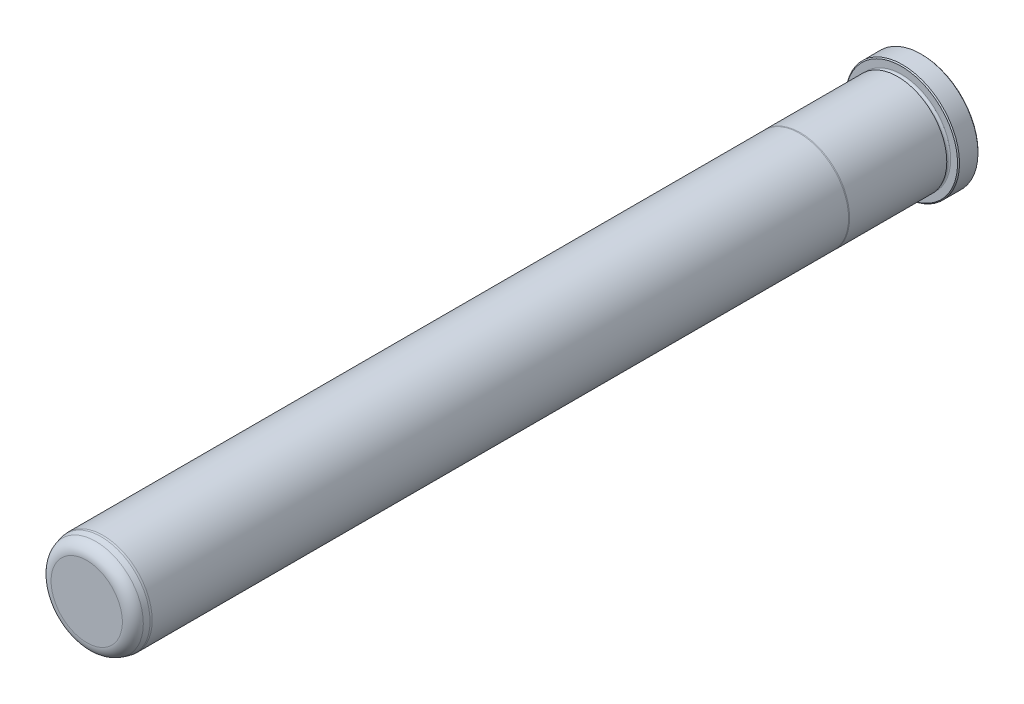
from build123d import *

# Parameters (mm, degrees)
FILLET6_R     = 4.7625
CHAMFER1_SIZE = 0.381


with BuildPart() as part:
    # Sketch1 → Revolve1 (revolve)
    with BuildSketch(Plane(origin=(0, 0, 0), x_dir=(0, 0, -1), z_dir=(1, 0, 0)), mode=Mode.PRIVATE) as revolve1_sk:
        with BuildLine():
            Line((0, 0), (0, 22.098))
            Line((0, 22.098), (-7.9248, 22.098))
            Line((-7.9248, 22.098), (-7.9248, 19.0373))
            ThreePointArc((-7.9248, 19.0373), (-8.6868, 18.2753), (-9.4488, 19.0373))
            Line((-9.4488, 19.0373), (-9.4488, 19.0627))
            Line((-9.4488, 19.0627), (-47.134763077, 19.0627))
            Line((-47.134763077, 19.0627), (-47.498, 19.0373))
            Line((-47.498, 19.0373), (-317.5, 19.0373))
            Line((-317.5, 19.0373), (-318.262, 18.970633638))
            Line((-318.262, 18.970633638), (-323.85, 17.473333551))
            Line((-323.85, 17.473333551), (-323.85, 0))
            Line((-323.85, 0), (0, 0))
        make_face()
    revolve(revolve1_sk.sketch.rotate(Axis((0, 0, 0), (0, 0, -1)), 90), axis=Axis((0, 0, 0), (0, 0, -1)))

    # Fillet6
    fillet6_edges = [part.edges().sort_by_distance(p)[0] for p in [
        (-17.473333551, 0, 323.85),
    ]]
    fillet(fillet6_edges, radius=FILLET6_R)

    # Chamfer1
    chamfer1_edges = [part.edges().sort_by_distance(p)[0] for p in [
        (-22.098, 0, 7.9248),
        (-22.098, 0, 0),
    ]]
    chamfer(chamfer1_edges, length=CHAMFER1_SIZE)


solid = part.part
